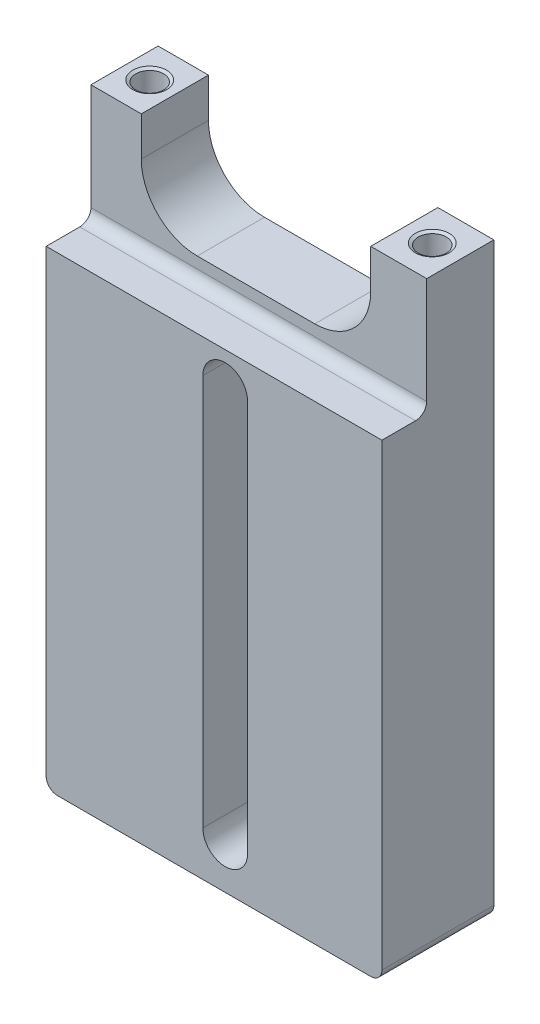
from build123d import *

# Parameters (mm, degrees)
BOSS_EXTRU_1_DEPTH          = 20
ESQUISSE3_W                 = 60
ESQUISSE3_H                 = 55.670454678
ENL_V_MAT_EXTRU_1_DEPTH     = 8
ENL_V_MAT_EXTRU_2_REACH     = 113.018
CONG_2_R                    = 2
TROU_TARAUD_M61_D           = 5
TROU_TARAUD_M61_DEPTH       = 27
TROU_TARAUD_M61_CSINK_D     = 6.05
TROU_TARAUD_M61_CSINK_ANGLE = 120
TROU_TARAUD_M61_TIP         = 1.502151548


with BuildPart() as part:
    # Esquisse1 → Boss.-Extru.1 (new body)
    with BuildSketch(Plane.XY):
        with BuildLine():
            Line((30, 105), (30, 0))
            Line((30, 0), (-30, 0))
            Line((-30, 0), (-30, 105))
            Line((-30, 105), (-21, 105))
            Line((-21, 105), (-21, 98))
            ThreePointArc((-21, 98), (-18.071067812, 90.928932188), (-11, 88))
            Line((-11, 88), (10, 88))
            ThreePointArc((10, 88), (17.071067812, 90.928932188), (20, 98))
            Line((20, 98), (20, 105))
            Line((20, 105), (30, 105))
        make_face()
    extrude(amount=BOSS_EXTRU_1_DEPTH)

    # Esquisse3 → Enl_v. mat.-Extru.1 (cut)
    with BuildSketch(Plane.XY.offset(20)):
        with Locations((0, 111.835227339)):
            Rectangle(ESQUISSE3_W, ESQUISSE3_H)
    extrude(amount=-ENL_V_MAT_EXTRU_1_DEPTH, mode=Mode.SUBTRACT)

    # Esquisse4 → Enl_v. mat.-Extru.2 (cut, up to next)
    with BuildSketch(Plane(origin=(0, 0, 0), x_dir=(-1, 0, 0), z_dir=(0, 0, -1)), mode=Mode.PRIVATE) as enl_v_mat_extru_2_sk1:
        with BuildLine():
            Line((-6, 78), (-6, 8))
            ThreePointArc((-6, 8), (-2, 4), (2, 8))
            Line((2, 8), (2, 78))
            ThreePointArc((2, 78), (-2, 82), (-6, 78))
        make_face()
    enl_v_mat_extru_2_tool1 = extrude(enl_v_mat_extru_2_sk1.sketch, amount=-ENL_V_MAT_EXTRU_2_REACH, mode=Mode.PRIVATE) & part.part
    add(enl_v_mat_extru_2_tool1.solids().sort_by_distance((2, 43, 0))[0], mode=Mode.SUBTRACT)

    # Cong_2
    cong_2_edges = [part.edges().sort_by_distance(p)[0] for p in [
        (30, 0, 10),
        (-30, 0, 10),
        (0, 84, 12),
    ]]
    fillet(cong_2_edges, radius=CONG_2_R)

    # Trou taraud_ M61
    with Locations(Plane(origin=(0, 105, 0), x_dir=(-1, 0, 0), z_dir=(0, 1, 0))):
        with Locations((25.5, 6), (-25, 6)):
            CounterSinkHole(TROU_TARAUD_M61_D / 2, TROU_TARAUD_M61_CSINK_D / 2, depth=TROU_TARAUD_M61_DEPTH, counter_sink_angle=TROU_TARAUD_M61_CSINK_ANGLE)
            with Locations((0, 0, -(TROU_TARAUD_M61_DEPTH + TROU_TARAUD_M61_TIP / 2))):  # 118° drill point
                Cone(0, TROU_TARAUD_M61_D / 2, TROU_TARAUD_M61_TIP, mode=Mode.SUBTRACT)


solid = part.part
